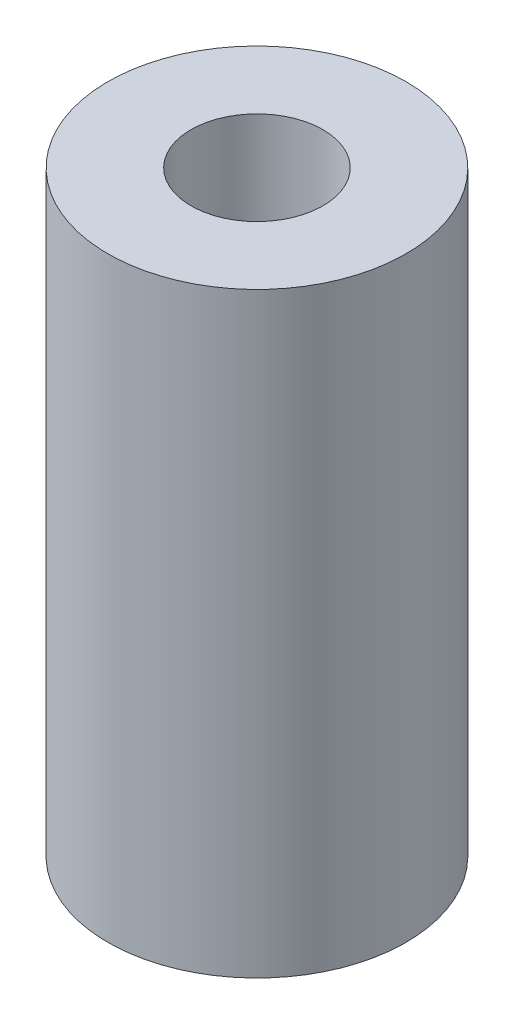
ISO-10303-21;
HEADER;
FILE_DESCRIPTION(('STEP AP214'),'2;1');
FILE_NAME('part.step','',(''),(''),'','','');
FILE_SCHEMA(('AUTOMOTIVE_DESIGN { 1 0 10303 214 1 1 1 1 }'));
ENDSEC;
DATA;
#1=APPLICATION_CONTEXT('core data for automotive mechanical design processes');
#2=APPLICATION_PROTOCOL_DEFINITION('international standard','automotive_design',2000,#1);
#3=PRODUCT_CONTEXT('',#1,'mechanical');
#4=PRODUCT('Part','Part','',(#3));
#5=PRODUCT_RELATED_PRODUCT_CATEGORY('part','',(#4));
#6=PRODUCT_DEFINITION_FORMATION('','',#4);
#7=PRODUCT_DEFINITION_CONTEXT('part definition',#1,'design');
#8=PRODUCT_DEFINITION('design','',#6,#7);
#9=PRODUCT_DEFINITION_SHAPE('','',#8);
#10=(LENGTH_UNIT() NAMED_UNIT(*) SI_UNIT(.MILLI.,.METRE.));
#11=(NAMED_UNIT(*) PLANE_ANGLE_UNIT() SI_UNIT($,.RADIAN.));
#12=(NAMED_UNIT(*) SI_UNIT($,.STERADIAN.) SOLID_ANGLE_UNIT());
#13=UNCERTAINTY_MEASURE_WITH_UNIT(LENGTH_MEASURE(1.E-05),#10,'distance_accuracy_value','');
#14=(GEOMETRIC_REPRESENTATION_CONTEXT(3) GLOBAL_UNCERTAINTY_ASSIGNED_CONTEXT((#13)) GLOBAL_UNIT_ASSIGNED_CONTEXT((#10,
#11,#12)) REPRESENTATION_CONTEXT('',''));
#15=CARTESIAN_POINT('',(0.,0.,0.));
#16=DIRECTION('',(0.,0.,1.));
#17=DIRECTION('',(1.,0.,0.));
#18=AXIS2_PLACEMENT_3D('',#15,#16,#17);
#19=CARTESIAN_POINT('',(0.,19.05,0.));
#20=DIRECTION('',(0.,1.,0.));
#21=DIRECTION('',(0.,0.,1.));
#22=AXIS2_PLACEMENT_3D('',#19,#20,#21);
#23=PLANE('',#22);
#24=CARTESIAN_POINT('',(0.,19.05,0.));
#25=DIRECTION('',(0.,1.,0.));
#26=DIRECTION('',(0.,0.,1.));
#27=AXIS2_PLACEMENT_3D('',#24,#25,#26);
#28=CIRCLE('',#27,4.7625);
#29=CARTESIAN_POINT('',(0.,19.05,-4.7625));
#30=VERTEX_POINT('',#29);
#31=EDGE_CURVE('E10',#30,#30,#28,.T.);
#32=ORIENTED_EDGE('',*,*,#31,.T.);
#33=EDGE_LOOP('',(#32));
#34=FACE_BOUND('',#33,.T.);
#35=CARTESIAN_POINT('',(0.,19.05,0.));
#36=DIRECTION('',(0.,1.,0.));
#37=DIRECTION('',(0.,0.,1.));
#38=AXIS2_PLACEMENT_3D('',#35,#36,#37);
#39=CIRCLE('',#38,2.1082);
#40=CARTESIAN_POINT('',(0.,19.05,-2.1082));
#41=VERTEX_POINT('',#40);
#42=EDGE_CURVE('E390',#41,#41,#39,.T.);
#43=ORIENTED_EDGE('',*,*,#42,.F.);
#44=EDGE_LOOP('',(#43));
#45=FACE_BOUND('',#44,.T.);
#46=ADVANCED_FACE('F379',(#34,#45),#23,.T.);
#47=CARTESIAN_POINT('',(0.,0.,0.));
#48=DIRECTION('',(0.,1.,0.));
#49=DIRECTION('',(0.,0.,1.));
#50=AXIS2_PLACEMENT_3D('',#47,#48,#49);
#51=PLANE('',#50);
#52=CARTESIAN_POINT('',(0.,0.,0.));
#53=DIRECTION('',(0.,1.,0.));
#54=DIRECTION('',(0.,0.,1.));
#55=AXIS2_PLACEMENT_3D('',#52,#53,#54);
#56=CIRCLE('',#55,4.7625);
#57=CARTESIAN_POINT('',(0.,0.,-4.7625));
#58=VERTEX_POINT('',#57);
#59=EDGE_CURVE('E386',#58,#58,#56,.T.);
#60=ORIENTED_EDGE('',*,*,#59,.F.);
#61=EDGE_LOOP('',(#60));
#62=FACE_BOUND('',#61,.T.);
#63=CARTESIAN_POINT('',(0.,0.,0.));
#64=DIRECTION('',(0.,1.,0.));
#65=DIRECTION('',(0.,0.,1.));
#66=AXIS2_PLACEMENT_3D('',#63,#64,#65);
#67=CIRCLE('',#66,2.1082);
#68=CARTESIAN_POINT('',(0.,0.,-2.1082));
#69=VERTEX_POINT('',#68);
#70=EDGE_CURVE('E394',#69,#69,#67,.T.);
#71=ORIENTED_EDGE('',*,*,#70,.T.);
#72=EDGE_LOOP('',(#71));
#73=FACE_BOUND('',#72,.T.);
#74=ADVANCED_FACE('F400',(#62,#73),#51,.F.);
#75=CARTESIAN_POINT('',(0.,19.05,0.));
#76=DIRECTION('',(0.,-1.,0.));
#77=DIRECTION('',(0.,0.,-1.));
#78=AXIS2_PLACEMENT_3D('',#75,#76,#77);
#79=CYLINDRICAL_SURFACE('',#78,4.7625);
#80=CARTESIAN_POINT('',(0.,19.05,-4.7625));
#81=CARTESIAN_POINT('',(0.,18.8515625,-4.7625));
#82=CARTESIAN_POINT('',(0.,18.653125,-4.7625));
#83=CARTESIAN_POINT('',(0.,18.25625,-4.7625));
#84=CARTESIAN_POINT('',(0.,18.0578125,-4.7625));
#85=CARTESIAN_POINT('',(0.,17.6609375,-4.7625));
#86=CARTESIAN_POINT('',(0.,17.4625,-4.7625));
#87=CARTESIAN_POINT('',(0.,17.065625,-4.7625));
#88=CARTESIAN_POINT('',(0.,16.8671875,-4.7625));
#89=CARTESIAN_POINT('',(0.,16.4703125,-4.7625));
#90=CARTESIAN_POINT('',(0.,16.271875,-4.7625));
#91=CARTESIAN_POINT('',(0.,15.875,-4.7625));
#92=CARTESIAN_POINT('',(0.,15.6765625,-4.7625));
#93=CARTESIAN_POINT('',(0.,15.2796875,-4.7625));
#94=CARTESIAN_POINT('',(0.,15.08125,-4.7625));
#95=CARTESIAN_POINT('',(0.,14.684375,-4.7625));
#96=CARTESIAN_POINT('',(0.,14.4859375,-4.7625));
#97=CARTESIAN_POINT('',(0.,14.0890625,-4.7625));
#98=CARTESIAN_POINT('',(0.,13.890625,-4.7625));
#99=CARTESIAN_POINT('',(0.,13.49375,-4.7625));
#100=CARTESIAN_POINT('',(0.,13.2953125,-4.7625));
#101=CARTESIAN_POINT('',(0.,12.8984375,-4.7625));
#102=CARTESIAN_POINT('',(0.,12.7,-4.7625));
#103=CARTESIAN_POINT('',(0.,12.303125,-4.7625));
#104=CARTESIAN_POINT('',(0.,12.1046875,-4.7625));
#105=CARTESIAN_POINT('',(0.,11.7078125,-4.7625));
#106=CARTESIAN_POINT('',(0.,11.509375,-4.7625));
#107=CARTESIAN_POINT('',(0.,11.1125,-4.7625));
#108=CARTESIAN_POINT('',(0.,10.9140625,-4.7625));
#109=CARTESIAN_POINT('',(0.,10.5171875,-4.7625));
#110=CARTESIAN_POINT('',(0.,10.31875,-4.7625));
#111=CARTESIAN_POINT('',(0.,9.921875,-4.7625));
#112=CARTESIAN_POINT('',(0.,9.7234375,-4.7625));
#113=CARTESIAN_POINT('',(0.,9.3265625,-4.7625));
#114=CARTESIAN_POINT('',(0.,9.128125,-4.7625));
#115=CARTESIAN_POINT('',(0.,8.73125,-4.7625));
#116=CARTESIAN_POINT('',(0.,8.5328125,-4.7625));
#117=CARTESIAN_POINT('',(0.,8.1359375,-4.7625));
#118=CARTESIAN_POINT('',(0.,7.9375,-4.7625));
#119=CARTESIAN_POINT('',(0.,7.540625,-4.7625));
#120=CARTESIAN_POINT('',(0.,7.3421875,-4.7625));
#121=CARTESIAN_POINT('',(0.,6.9453125,-4.7625));
#122=CARTESIAN_POINT('',(0.,6.746875,-4.7625));
#123=CARTESIAN_POINT('',(0.,6.35,-4.7625));
#124=CARTESIAN_POINT('',(0.,6.1515625,-4.7625));
#125=CARTESIAN_POINT('',(0.,5.7546875,-4.7625));
#126=CARTESIAN_POINT('',(0.,5.55625,-4.7625));
#127=CARTESIAN_POINT('',(0.,5.159375,-4.7625));
#128=CARTESIAN_POINT('',(0.,4.9609375,-4.7625));
#129=CARTESIAN_POINT('',(0.,4.5640625,-4.7625));
#130=CARTESIAN_POINT('',(0.,4.365625,-4.7625));
#131=CARTESIAN_POINT('',(0.,3.96875,-4.7625));
#132=CARTESIAN_POINT('',(0.,3.7703125,-4.7625));
#133=CARTESIAN_POINT('',(0.,3.3734375,-4.7625));
#134=CARTESIAN_POINT('',(0.,3.175,-4.7625));
#135=CARTESIAN_POINT('',(0.,2.778125,-4.7625));
#136=CARTESIAN_POINT('',(0.,2.5796875,-4.7625));
#137=CARTESIAN_POINT('',(0.,2.1828125,-4.7625));
#138=CARTESIAN_POINT('',(0.,1.984375,-4.7625));
#139=CARTESIAN_POINT('',(0.,1.5875,-4.7625));
#140=CARTESIAN_POINT('',(0.,1.3890625,-4.7625));
#141=CARTESIAN_POINT('',(0.,0.992187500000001,-4.7625));
#142=CARTESIAN_POINT('',(0.,0.793750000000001,-4.7625));
#143=CARTESIAN_POINT('',(0.,0.396875,-4.7625));
#144=CARTESIAN_POINT('',(0.,0.1984375,-4.7625));
#145=CARTESIAN_POINT('',(0.,0.,-4.7625));
#146=B_SPLINE_CURVE_WITH_KNOTS('',3,(#80,#81,#82,#83,#84,#85,#86,#87,#88,#89,#90,#91,#92,#93,
#94,#95,#96,#97,#98,#99,#100,#101,#102,#103,#104,#105,#106,#107,#108,#109,#110,#111,#112,#113,
#114,#115,#116,#117,#118,#119,#120,#121,#122,#123,#124,#125,#126,#127,#128,#129,#130,#131,#132,
#133,#134,#135,#136,#137,#138,#139,#140,#141,#142,#143,#144,#145),.UNSPECIFIED.,.F.,.F.,(4,2,2,
2,2,2,2,2,2,2,2,2,2,2,2,2,2,2,2,2,2,2,2,2,2,2,2,2,2,2,2,2,4),(0.,0.5953125,1.190625,1.7859375,
2.38125,2.9765625,3.571875,4.1671875,4.7625,5.3578125,5.953125,6.5484375,7.14375,7.7390625,
8.334375,8.9296875,9.525,10.1203125,10.715625,11.3109375,11.90625,12.5015625,13.096875,
13.6921875,14.2875,14.8828125,15.478125,16.0734375,16.66875,17.2640625,17.859375,18.4546875,
19.05),.UNSPECIFIED.);
#147=EDGE_CURVE('BSEAM381',#30,#58,#146,.T.);
#148=ORIENTED_EDGE('',*,*,#31,.F.);
#149=ORIENTED_EDGE('',*,*,#59,.T.);
#150=ORIENTED_EDGE('',*,*,#147,.T.);
#151=ORIENTED_EDGE('',*,*,#147,.F.);
#152=EDGE_LOOP('',(#148,#150,#149,#151));
#153=FACE_BOUND('',#152,.T.);
#154=ADVANCED_FACE('F381',(#153),#79,.T.);
#155=CARTESIAN_POINT('',(0.,19.05,0.));
#156=DIRECTION('',(0.,-1.,0.));
#157=DIRECTION('',(0.,0.,-1.));
#158=AXIS2_PLACEMENT_3D('',#155,#156,#157);
#159=CYLINDRICAL_SURFACE('',#158,2.1082);
#160=CARTESIAN_POINT('',(0.,19.05,-2.1082));
#161=CARTESIAN_POINT('',(0.,18.8515625,-2.1082));
#162=CARTESIAN_POINT('',(0.,18.653125,-2.1082));
#163=CARTESIAN_POINT('',(0.,18.25625,-2.1082));
#164=CARTESIAN_POINT('',(0.,18.0578125,-2.1082));
#165=CARTESIAN_POINT('',(0.,17.6609375,-2.1082));
#166=CARTESIAN_POINT('',(0.,17.4625,-2.1082));
#167=CARTESIAN_POINT('',(0.,17.065625,-2.1082));
#168=CARTESIAN_POINT('',(0.,16.8671875,-2.1082));
#169=CARTESIAN_POINT('',(0.,16.4703125,-2.1082));
#170=CARTESIAN_POINT('',(0.,16.271875,-2.1082));
#171=CARTESIAN_POINT('',(0.,15.875,-2.1082));
#172=CARTESIAN_POINT('',(0.,15.6765625,-2.1082));
#173=CARTESIAN_POINT('',(0.,15.2796875,-2.1082));
#174=CARTESIAN_POINT('',(0.,15.08125,-2.1082));
#175=CARTESIAN_POINT('',(0.,14.684375,-2.1082));
#176=CARTESIAN_POINT('',(0.,14.4859375,-2.1082));
#177=CARTESIAN_POINT('',(0.,14.0890625,-2.1082));
#178=CARTESIAN_POINT('',(0.,13.890625,-2.1082));
#179=CARTESIAN_POINT('',(0.,13.49375,-2.1082));
#180=CARTESIAN_POINT('',(0.,13.2953125,-2.1082));
#181=CARTESIAN_POINT('',(0.,12.8984375,-2.1082));
#182=CARTESIAN_POINT('',(0.,12.7,-2.1082));
#183=CARTESIAN_POINT('',(0.,12.303125,-2.1082));
#184=CARTESIAN_POINT('',(0.,12.1046875,-2.1082));
#185=CARTESIAN_POINT('',(0.,11.7078125,-2.1082));
#186=CARTESIAN_POINT('',(0.,11.509375,-2.1082));
#187=CARTESIAN_POINT('',(0.,11.1125,-2.1082));
#188=CARTESIAN_POINT('',(0.,10.9140625,-2.1082));
#189=CARTESIAN_POINT('',(0.,10.5171875,-2.1082));
#190=CARTESIAN_POINT('',(0.,10.31875,-2.1082));
#191=CARTESIAN_POINT('',(0.,9.921875,-2.1082));
#192=CARTESIAN_POINT('',(0.,9.7234375,-2.1082));
#193=CARTESIAN_POINT('',(0.,9.3265625,-2.1082));
#194=CARTESIAN_POINT('',(0.,9.128125,-2.1082));
#195=CARTESIAN_POINT('',(0.,8.73125,-2.1082));
#196=CARTESIAN_POINT('',(0.,8.5328125,-2.1082));
#197=CARTESIAN_POINT('',(0.,8.1359375,-2.1082));
#198=CARTESIAN_POINT('',(0.,7.9375,-2.1082));
#199=CARTESIAN_POINT('',(0.,7.540625,-2.1082));
#200=CARTESIAN_POINT('',(0.,7.3421875,-2.1082));
#201=CARTESIAN_POINT('',(0.,6.9453125,-2.1082));
#202=CARTESIAN_POINT('',(0.,6.746875,-2.1082));
#203=CARTESIAN_POINT('',(0.,6.35,-2.1082));
#204=CARTESIAN_POINT('',(0.,6.1515625,-2.1082));
#205=CARTESIAN_POINT('',(0.,5.7546875,-2.1082));
#206=CARTESIAN_POINT('',(0.,5.55625,-2.1082));
#207=CARTESIAN_POINT('',(0.,5.159375,-2.1082));
#208=CARTESIAN_POINT('',(0.,4.9609375,-2.1082));
#209=CARTESIAN_POINT('',(0.,4.5640625,-2.1082));
#210=CARTESIAN_POINT('',(0.,4.365625,-2.1082));
#211=CARTESIAN_POINT('',(0.,3.96875,-2.1082));
#212=CARTESIAN_POINT('',(0.,3.7703125,-2.1082));
#213=CARTESIAN_POINT('',(0.,3.3734375,-2.1082));
#214=CARTESIAN_POINT('',(0.,3.175,-2.1082));
#215=CARTESIAN_POINT('',(0.,2.778125,-2.1082));
#216=CARTESIAN_POINT('',(0.,2.5796875,-2.1082));
#217=CARTESIAN_POINT('',(0.,2.1828125,-2.1082));
#218=CARTESIAN_POINT('',(0.,1.984375,-2.1082));
#219=CARTESIAN_POINT('',(0.,1.5875,-2.1082));
#220=CARTESIAN_POINT('',(0.,1.3890625,-2.1082));
#221=CARTESIAN_POINT('',(0.,0.992187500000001,-2.1082));
#222=CARTESIAN_POINT('',(0.,0.793750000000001,-2.1082));
#223=CARTESIAN_POINT('',(0.,0.396875,-2.1082));
#224=CARTESIAN_POINT('',(0.,0.1984375,-2.1082));
#225=CARTESIAN_POINT('',(0.,0.,-2.1082));
#226=B_SPLINE_CURVE_WITH_KNOTS('',3,(#160,#161,#162,#163,#164,#165,#166,#167,#168,#169,#170,
#171,#172,#173,#174,#175,#176,#177,#178,#179,#180,#181,#182,#183,#184,#185,#186,#187,#188,#189,
#190,#191,#192,#193,#194,#195,#196,#197,#198,#199,#200,#201,#202,#203,#204,#205,#206,#207,#208,
#209,#210,#211,#212,#213,#214,#215,#216,#217,#218,#219,#220,#221,#222,#223,#224,#225),
.UNSPECIFIED.,.F.,.F.,(4,2,2,2,2,2,2,2,2,2,2,2,2,2,2,2,2,2,2,2,2,2,2,2,2,2,2,2,2,2,2,2,4),(0.,
0.5953125,1.190625,1.7859375,2.38125,2.9765625,3.571875,4.1671875,4.7625,5.3578125,5.953125,
6.5484375,7.14375,7.7390625,8.334375,8.9296875,9.525,10.1203125,10.715625,11.3109375,11.90625,
12.5015625,13.096875,13.6921875,14.2875,14.8828125,15.478125,16.0734375,16.66875,17.2640625,
17.859375,18.4546875,19.05),.UNSPECIFIED.);
#227=EDGE_CURVE('BSEAM402',#41,#69,#226,.T.);
#228=ORIENTED_EDGE('',*,*,#42,.T.);
#229=ORIENTED_EDGE('',*,*,#70,.F.);
#230=ORIENTED_EDGE('',*,*,#227,.T.);
#231=ORIENTED_EDGE('',*,*,#227,.F.);
#232=EDGE_LOOP('',(#228,#230,#229,#231));
#233=FACE_BOUND('',#232,.T.);
#234=ADVANCED_FACE('F402',(#233),#159,.F.);
#235=CLOSED_SHELL('',(#46,#74,#154,#234));
#236=MANIFOLD_SOLID_BREP('B2',#235);
#237=ADVANCED_BREP_SHAPE_REPRESENTATION('',(#18,#236),#14);
#238=SHAPE_DEFINITION_REPRESENTATION(#9,#237);
ENDSEC;
END-ISO-10303-21;
